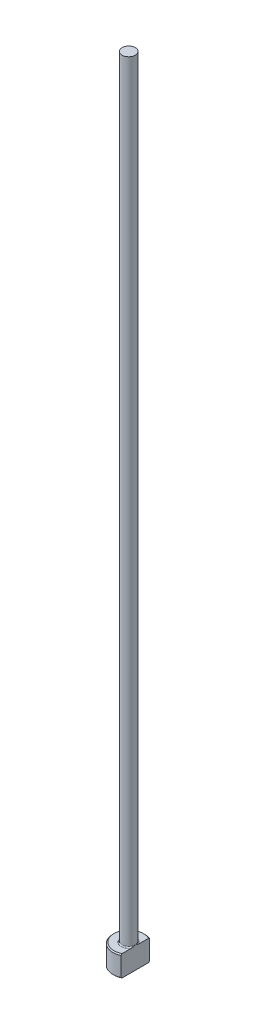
ISO-10303-21;
HEADER;
FILE_DESCRIPTION(('STEP AP214'),'2;1');
FILE_NAME('part.step','',(''),(''),'','','');
FILE_SCHEMA(('AUTOMOTIVE_DESIGN { 1 0 10303 214 1 1 1 1 }'));
ENDSEC;
DATA;
#1=APPLICATION_CONTEXT('core data for automotive mechanical design processes');
#2=APPLICATION_PROTOCOL_DEFINITION('international standard','automotive_design',2000,#1);
#3=PRODUCT_CONTEXT('',#1,'mechanical');
#4=PRODUCT('Part','Part','',(#3));
#5=PRODUCT_RELATED_PRODUCT_CATEGORY('part','',(#4));
#6=PRODUCT_DEFINITION_FORMATION('','',#4);
#7=PRODUCT_DEFINITION_CONTEXT('part definition',#1,'design');
#8=PRODUCT_DEFINITION('design','',#6,#7);
#9=PRODUCT_DEFINITION_SHAPE('','',#8);
#10=(LENGTH_UNIT() NAMED_UNIT(*) SI_UNIT(.MILLI.,.METRE.));
#11=(NAMED_UNIT(*) PLANE_ANGLE_UNIT() SI_UNIT($,.RADIAN.));
#12=(NAMED_UNIT(*) SI_UNIT($,.STERADIAN.) SOLID_ANGLE_UNIT());
#13=UNCERTAINTY_MEASURE_WITH_UNIT(LENGTH_MEASURE(1.E-05),#10,'distance_accuracy_value','');
#14=(GEOMETRIC_REPRESENTATION_CONTEXT(3) GLOBAL_UNCERTAINTY_ASSIGNED_CONTEXT((#13)) GLOBAL_UNIT_ASSIGNED_CONTEXT((#10,
#11,#12)) REPRESENTATION_CONTEXT('',''));
#15=CARTESIAN_POINT('',(0.,0.,0.));
#16=DIRECTION('',(0.,0.,1.));
#17=DIRECTION('',(1.,0.,0.));
#18=AXIS2_PLACEMENT_3D('',#15,#16,#17);
#19=CARTESIAN_POINT('',(0.,0.,0.));
#20=DIRECTION('',(0.,-1.,0.));
#21=DIRECTION('',(0.,0.,-1.));
#22=AXIS2_PLACEMENT_3D('',#19,#20,#21);
#23=PLANE('',#22);
#24=CARTESIAN_POINT('',(0.,0.,0.));
#25=DIRECTION('',(0.,-1.,0.));
#26=DIRECTION('',(0.,0.,-1.));
#27=AXIS2_PLACEMENT_3D('',#24,#25,#26);
#28=CIRCLE('',#27,2.8);
#29=CARTESIAN_POINT('',(1.24999999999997,0.,2.50549396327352));
#30=VERTEX_POINT('',#29);
#31=CARTESIAN_POINT('',(1.24999999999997,0.,-2.50549396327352));
#32=VERTEX_POINT('',#31);
#33=EDGE_CURVE('E98',#30,#32,#28,.T.);
#34=ORIENTED_EDGE('',*,*,#33,.T.);
#35=DIRECTION('',(0.,0.,1.));
#36=VECTOR('',#35,1.);
#37=CARTESIAN_POINT('',(1.24999999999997,0.,2.72717802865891));
#38=LINE('',#37,#36);
#39=EDGE_CURVE('E83',#32,#30,#38,.T.);
#40=ORIENTED_EDGE('',*,*,#39,.T.);
#41=EDGE_LOOP('',(#34,#40));
#42=FACE_BOUND('',#41,.T.);
#43=ADVANCED_FACE('F32',(#42),#23,.T.);
#44=CARTESIAN_POINT('',(0.,259.958771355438,0.));
#45=DIRECTION('',(0.,1.,0.));
#46=DIRECTION('',(0.,0.,1.));
#47=AXIS2_PLACEMENT_3D('',#44,#45,#46);
#48=CYLINDRICAL_SURFACE('',#47,2.99999999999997);
#49=CARTESIAN_POINT('',(0.,3.79999999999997,0.));
#50=DIRECTION('',(0.,1.,0.));
#51=DIRECTION('',(0.,0.,1.));
#52=AXIS2_PLACEMENT_3D('',#49,#50,#51);
#53=CIRCLE('',#52,2.99999999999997);
#54=CARTESIAN_POINT('',(1.24999999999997,3.79999999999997,2.72717802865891));
#55=VERTEX_POINT('',#54);
#56=CARTESIAN_POINT('',(1.24999999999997,3.79999999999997,-2.72717802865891));
#57=VERTEX_POINT('',#56);
#58=EDGE_CURVE('E104',#55,#57,#53,.F.);
#59=ORIENTED_EDGE('',*,*,#58,.T.);
#60=DIRECTION('',(0.,-1.,0.));
#61=VECTOR('',#60,1.);
#62=CARTESIAN_POINT('',(1.24999999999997,150.,-2.72717802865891));
#63=LINE('',#62,#61);
#64=CARTESIAN_POINT('',(1.24999999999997,0.199999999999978,-2.72717802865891));
#65=VERTEX_POINT('',#64);
#66=EDGE_CURVE('E183',#57,#65,#63,.T.);
#67=ORIENTED_EDGE('',*,*,#66,.T.);
#68=CARTESIAN_POINT('',(0.,0.199999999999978,0.));
#69=DIRECTION('',(0.,-1.,0.));
#70=DIRECTION('',(0.,0.,-1.));
#71=AXIS2_PLACEMENT_3D('',#68,#69,#70);
#72=CIRCLE('',#71,2.99999999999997);
#73=CARTESIAN_POINT('',(1.24999999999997,0.199999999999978,2.72717802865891));
#74=VERTEX_POINT('',#73);
#75=EDGE_CURVE('E100',#65,#74,#72,.F.);
#76=ORIENTED_EDGE('',*,*,#75,.T.);
#77=DIRECTION('',(0.,-1.,0.));
#78=VECTOR('',#77,1.);
#79=CARTESIAN_POINT('',(1.24999999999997,150.,2.72717802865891));
#80=LINE('',#79,#78);
#81=EDGE_CURVE('E93',#55,#74,#80,.T.);
#82=ORIENTED_EDGE('',*,*,#81,.F.);
#83=EDGE_LOOP('',(#59,#67,#76,#82));
#84=FACE_BOUND('',#83,.T.);
#85=ADVANCED_FACE('F158',(#84),#48,.T.);
#86=CARTESIAN_POINT('',(-2.99999999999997,4.,0.));
#87=DIRECTION('',(0.,1.,0.));
#88=DIRECTION('',(0.,0.,1.));
#89=AXIS2_PLACEMENT_3D('',#86,#87,#88);
#90=PLANE('',#89);
#91=CARTESIAN_POINT('',(0.,4.,0.));
#92=DIRECTION('',(0.,1.,0.));
#93=DIRECTION('',(0.,0.,1.));
#94=AXIS2_PLACEMENT_3D('',#91,#92,#93);
#95=CIRCLE('',#94,2.79999999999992);
#96=CARTESIAN_POINT('',(1.24999999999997,4.,-2.50549396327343));
#97=VERTEX_POINT('',#96);
#98=CARTESIAN_POINT('',(1.24999999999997,4.,2.50549396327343));
#99=VERTEX_POINT('',#98);
#100=EDGE_CURVE('E178',#97,#99,#95,.T.);
#101=ORIENTED_EDGE('',*,*,#100,.T.);
#102=DIRECTION('',(0.,0.,-1.));
#103=VECTOR('',#102,1.);
#104=CARTESIAN_POINT('',(1.24999999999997,4.,0.));
#105=LINE('',#104,#103);
#106=CARTESIAN_POINT('',(1.24999999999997,3.99999999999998,0.734846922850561));
#107=VERTEX_POINT('',#106);
#108=EDGE_CURVE('E57',#99,#107,#105,.T.);
#109=ORIENTED_EDGE('',*,*,#108,.T.);
#110=CARTESIAN_POINT('',(0.,4.,0.));
#111=DIRECTION('',(0.,1.,0.));
#112=DIRECTION('',(0.,0.,1.));
#113=AXIS2_PLACEMENT_3D('',#110,#111,#112);
#114=CIRCLE('',#113,1.44999999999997);
#115=CARTESIAN_POINT('',(1.24999999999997,3.99999999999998,-0.734846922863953));
#116=VERTEX_POINT('',#115);
#117=EDGE_CURVE('E107',#107,#116,#114,.F.);
#118=ORIENTED_EDGE('',*,*,#117,.T.);
#119=EDGE_CURVE('E136',#116,#97,#105,.T.);
#120=ORIENTED_EDGE('',*,*,#119,.T.);
#121=EDGE_LOOP('',(#101,#109,#118,#120));
#122=FACE_BOUND('',#121,.T.);
#123=ADVANCED_FACE('F147',(#122),#90,.T.);
#124=CARTESIAN_POINT('',(0.,4.,0.));
#125=DIRECTION('',(0.,-1.,0.));
#126=DIRECTION('',(0.,0.,-1.));
#127=AXIS2_PLACEMENT_3D('',#124,#125,#126);
#128=CONICAL_SURFACE('',#127,2.79999999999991,0.7853981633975);
#129=ORIENTED_EDGE('',*,*,#58,.F.);
#130=CARTESIAN_POINT('',(1.24999999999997,0.669029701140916,6.00219100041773));
#131=CARTESIAN_POINT('',(1.24999999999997,0.811608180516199,5.85654654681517));
#132=CARTESIAN_POINT('',(1.24999999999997,0.954083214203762,5.71080056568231));
#133=CARTESIAN_POINT('',(1.24999999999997,1.23900024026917,5.41878816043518));
#134=CARTESIAN_POINT('',(1.24999999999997,1.38144175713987,5.2725212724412));
#135=CARTESIAN_POINT('',(1.24999999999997,1.67009506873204,4.97540906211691));
#136=CARTESIAN_POINT('',(1.24999999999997,1.81629662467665,4.82455378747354));
#137=CARTESIAN_POINT('',(1.24999999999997,2.10796282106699,4.52263591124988));
#138=CARTESIAN_POINT('',(1.24999999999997,2.25342829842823,4.37157411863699));
#139=CARTESIAN_POINT('',(1.24999999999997,2.53664042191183,4.07620034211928));
#140=CARTESIAN_POINT('',(1.24999999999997,2.67441792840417,3.93191797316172));
#141=CARTESIAN_POINT('',(1.24999999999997,2.94919792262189,3.64255917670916));
#142=CARTESIAN_POINT('',(1.24999999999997,3.08620024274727,3.49748258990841));
#143=CARTESIAN_POINT('',(1.24999999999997,3.36003302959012,3.20523168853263));
#144=CARTESIAN_POINT('',(1.24999999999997,3.49685542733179,3.05804979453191));
#145=CARTESIAN_POINT('',(1.24999999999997,3.76866895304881,2.76222351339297));
#146=CARTESIAN_POINT('',(1.24999999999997,3.90366148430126,2.61358041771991));
#147=CARTESIAN_POINT('',(1.24999999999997,4.1672507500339,2.31803303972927));
#148=CARTESIAN_POINT('',(1.24999999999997,4.29592101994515,2.17119494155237));
#149=CARTESIAN_POINT('',(1.24999999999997,4.48585031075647,1.94789558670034));
#150=CARTESIAN_POINT('',(1.24999999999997,4.54874737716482,1.87283059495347));
#151=CARTESIAN_POINT('',(1.24999999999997,4.67301560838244,1.7214647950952));
#152=CARTESIAN_POINT('',(1.24999999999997,4.73438704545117,1.64516421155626));
#153=CARTESIAN_POINT('',(1.24999999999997,4.85417557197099,1.49197305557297));
#154=CARTESIAN_POINT('',(1.24999999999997,4.91262187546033,1.41510543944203));
#155=CARTESIAN_POINT('',(1.24999999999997,5.02658525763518,1.25910555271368));
#156=CARTESIAN_POINT('',(1.24999999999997,5.08209990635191,1.17997148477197));
#157=CARTESIAN_POINT('',(1.24999999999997,5.18831713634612,1.01914711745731));
#158=CARTESIAN_POINT('',(1.24999999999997,5.239044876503,0.937473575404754));
#159=CARTESIAN_POINT('',(1.24999999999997,5.33341065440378,0.770163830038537));
#160=CARTESIAN_POINT('',(1.24999999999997,5.37706287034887,0.684536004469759));
#161=CARTESIAN_POINT('',(1.24999999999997,5.42311846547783,0.577571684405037));
#162=CARTESIAN_POINT('',(1.24999999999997,5.43098597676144,0.558575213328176));
#163=CARTESIAN_POINT('',(1.24999999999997,5.44613719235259,0.520340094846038));
#164=CARTESIAN_POINT('',(1.24999999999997,5.45342063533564,0.501101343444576));
#165=CARTESIAN_POINT('',(1.24999999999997,5.46734064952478,0.462392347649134));
#166=CARTESIAN_POINT('',(1.24999999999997,5.47397728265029,0.442922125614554));
#167=CARTESIAN_POINT('',(1.24999999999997,5.48654090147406,0.403756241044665));
#168=CARTESIAN_POINT('',(1.24999999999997,5.49246793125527,0.384060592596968));
#169=CARTESIAN_POINT('',(1.24999999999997,5.50889838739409,0.325328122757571));
#170=CARTESIAN_POINT('',(1.24999999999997,5.5182970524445,0.285972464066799));
#171=CARTESIAN_POINT('',(1.24999999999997,5.53364447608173,0.206573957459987));
#172=CARTESIAN_POINT('',(1.24999999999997,5.53959211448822,0.166530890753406));
#173=CARTESIAN_POINT('',(1.24999999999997,5.54775364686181,0.0853257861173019));
#174=CARTESIAN_POINT('',(1.24999999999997,5.54989812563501,0.0441566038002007));
#175=CARTESIAN_POINT('',(1.24999999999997,5.55009472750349,-0.0381787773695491));
#176=CARTESIAN_POINT('',(1.24999999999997,5.54814807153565,-0.0793449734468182));
#177=CARTESIAN_POINT('',(1.24999999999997,5.54028608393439,-0.161410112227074));
#178=CARTESIAN_POINT('',(1.24999999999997,5.53435930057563,-0.202307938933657));
#179=CARTESIAN_POINT('',(1.24999999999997,5.5188913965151,-0.283420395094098));
#180=CARTESIAN_POINT('',(1.24999999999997,5.50934853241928,-0.323634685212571));
#181=CARTESIAN_POINT('',(1.24999999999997,5.48253027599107,-0.419701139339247));
#182=CARTESIAN_POINT('',(1.24999999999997,5.46368943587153,-0.475114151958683));
#183=CARTESIAN_POINT('',(1.24999999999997,5.42119888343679,-0.584051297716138));
#184=CARTESIAN_POINT('',(1.24999999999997,5.39754618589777,-0.637574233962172));
#185=CARTESIAN_POINT('',(1.24999999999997,5.34650154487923,-0.743173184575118));
#186=CARTESIAN_POINT('',(1.24999999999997,5.31908834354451,-0.795238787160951));
#187=CARTESIAN_POINT('',(1.24999999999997,5.26156746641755,-0.897817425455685));
#188=CARTESIAN_POINT('',(1.24999999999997,5.23146075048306,-0.948331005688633));
#189=CARTESIAN_POINT('',(1.24999999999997,5.1642123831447,-1.05610178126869));
#190=CARTESIAN_POINT('',(1.24999999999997,5.12671791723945,-1.11313743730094));
#191=CARTESIAN_POINT('',(1.24999999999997,5.04971534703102,-1.2258386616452));
#192=CARTESIAN_POINT('',(1.24999999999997,5.01020681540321,-1.28150393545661));
#193=CARTESIAN_POINT('',(1.24999999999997,4.88938978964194,-1.44694956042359));
#194=CARTESIAN_POINT('',(1.24999999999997,4.80584655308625,-1.55509257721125));
#195=CARTESIAN_POINT('',(1.24999999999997,4.63502000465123,-1.76881938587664));
#196=CARTESIAN_POINT('',(1.24999999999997,4.54772710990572,-1.87439538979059));
#197=CARTESIAN_POINT('',(1.24999999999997,4.37088701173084,-2.0835553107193));
#198=CARTESIAN_POINT('',(1.24999999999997,4.28134083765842,-2.18714010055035));
#199=CARTESIAN_POINT('',(1.24999999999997,4.10042772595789,-2.39324626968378));
#200=CARTESIAN_POINT('',(1.24999999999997,4.00905617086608,-2.4957635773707));
#201=CARTESIAN_POINT('',(1.24999999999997,3.82518962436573,-2.69980391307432));
#202=CARTESIAN_POINT('',(1.24999999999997,3.73269451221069,-2.80132683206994));
#203=CARTESIAN_POINT('',(1.24999999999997,3.45429710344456,-3.10446128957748));
#204=CARTESIAN_POINT('',(1.24999999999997,3.26719139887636,-3.30496607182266));
#205=CARTESIAN_POINT('',(1.24999999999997,2.87989899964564,-3.7161356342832));
#206=CARTESIAN_POINT('',(1.24999999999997,2.67959819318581,-3.92669240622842));
#207=CARTESIAN_POINT('',(1.24999999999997,2.27757992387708,-4.3466606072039));
#208=CARTESIAN_POINT('',(1.24999999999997,2.07586177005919,-4.55607137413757));
#209=CARTESIAN_POINT('',(1.24999999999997,1.67356669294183,-4.97197982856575));
#210=CARTESIAN_POINT('',(1.24999999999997,1.47299831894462,-5.17848579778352));
#211=CARTESIAN_POINT('',(1.24999999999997,1.0713592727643,-5.59078665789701));
#212=CARTESIAN_POINT('',(1.24999999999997,0.870288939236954,-5.79658187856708));
#213=CARTESIAN_POINT('',(1.24999999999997,0.669029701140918,-6.00219100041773));
#214=B_SPLINE_CURVE_WITH_KNOTS('',3,(#130,#131,#132,#133,#134,#135,#136,#137,#138,#139,#140,
#141,#142,#143,#144,#145,#146,#147,#148,#149,#150,#151,#152,#153,#154,#155,#156,#157,#158,#159,
#160,#161,#162,#163,#164,#165,#166,#167,#168,#169,#170,#171,#172,#173,#174,#175,#176,#177,#178,
#179,#180,#181,#182,#183,#184,#185,#186,#187,#188,#189,#190,#191,#192,#193,#194,#195,#196,#197,
#198,#199,#200,#201,#202,#203,#204,#205,#206,#207,#208,#209,#210,#211,#212,#213),.UNSPECIFIED.,
.F.,.F.,(4,2,2,2,2,2,2,2,2,2,2,2,2,2,2,2,2,2,2,2,2,2,2,2,2,2,2,2,2,2,2,2,2,2,2,2,2,2,2,2,2,4),
(0.,0.611447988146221,1.22394436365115,1.8541735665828,2.48331351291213,3.0818096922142,
3.68043067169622,4.28328558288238,4.8856485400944,5.4712985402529,5.76508275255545,
6.05881415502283,6.34846123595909,6.63834474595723,6.92660821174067,7.21428670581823,
7.27596254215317,7.33766582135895,7.39936318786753,7.46105671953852,7.58229876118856,
7.70358013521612,7.82705319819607,7.95048941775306,8.07428232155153,8.19813498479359,
8.37340718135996,8.54878844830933,8.72520546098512,8.90155985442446,9.10626834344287,
9.31102044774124,9.72083602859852,10.1317697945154,10.5425191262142,10.9544882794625,
11.3665021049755,12.1892148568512,13.0610401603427,13.9333249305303,14.7969505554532,
15.6600991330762),.UNSPECIFIED.);
#215=EDGE_CURVE('E135',#55,#99,#214,.T.);
#216=ORIENTED_EDGE('',*,*,#215,.T.);
#217=ORIENTED_EDGE('',*,*,#100,.F.);
#218=EDGE_CURVE('E127',#97,#57,#214,.T.);
#219=ORIENTED_EDGE('',*,*,#218,.T.);
#220=EDGE_LOOP('',(#129,#216,#217,#219));
#221=FACE_BOUND('',#220,.T.);
#222=ADVANCED_FACE('F143',(#221),#128,.T.);
#223=CARTESIAN_POINT('',(0.,0.199999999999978,0.));
#224=DIRECTION('',(0.,1.,0.));
#225=DIRECTION('',(0.,0.,1.));
#226=AXIS2_PLACEMENT_3D('',#223,#224,#225);
#227=CONICAL_SURFACE('',#226,2.99999999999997,0.785398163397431);
#228=ORIENTED_EDGE('',*,*,#75,.F.);
#229=CARTESIAN_POINT('',(1.24999999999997,3.33097029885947,-6.00219100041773));
#230=CARTESIAN_POINT('',(1.24999999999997,3.18839181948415,-5.85654654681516));
#231=CARTESIAN_POINT('',(1.24999999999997,3.04591678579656,-5.71080056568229));
#232=CARTESIAN_POINT('',(1.24999999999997,2.76099975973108,-5.41878816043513));
#233=CARTESIAN_POINT('',(1.24999999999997,2.61855824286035,-5.27252127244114));
#234=CARTESIAN_POINT('',(1.24999999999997,2.32990493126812,-4.97540906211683));
#235=CARTESIAN_POINT('',(1.24999999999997,2.18370337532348,-4.82455378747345));
#236=CARTESIAN_POINT('',(1.24999999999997,1.89203717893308,-4.52263591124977));
#237=CARTESIAN_POINT('',(1.24999999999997,1.74657170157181,-4.37157411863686));
#238=CARTESIAN_POINT('',(1.24999999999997,1.46335957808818,-4.07620034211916));
#239=CARTESIAN_POINT('',(1.24999999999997,1.32558207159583,-3.93191797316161));
#240=CARTESIAN_POINT('',(1.24999999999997,1.0508020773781,-3.64255917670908));
#241=CARTESIAN_POINT('',(1.24999999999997,0.913799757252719,-3.49748258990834));
#242=CARTESIAN_POINT('',(1.24999999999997,0.639966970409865,-3.2052316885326));
#243=CARTESIAN_POINT('',(1.24999999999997,0.503144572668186,-3.0580497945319));
#244=CARTESIAN_POINT('',(1.24999999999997,0.231331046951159,-2.76222351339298));
#245=CARTESIAN_POINT('',(1.24999999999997,0.096338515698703,-2.61358041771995));
#246=CARTESIAN_POINT('',(1.24999999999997,-0.16725075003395,-2.31803303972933));
#247=CARTESIAN_POINT('',(1.24999999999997,-0.2959210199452,-2.17119494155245));
#248=CARTESIAN_POINT('',(1.24999999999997,-0.485850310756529,-1.94789558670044));
#249=CARTESIAN_POINT('',(1.24999999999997,-0.548747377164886,-1.87283059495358));
#250=CARTESIAN_POINT('',(1.24999999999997,-0.673015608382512,-1.72146479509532));
#251=CARTESIAN_POINT('',(1.24999999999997,-0.73438704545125,-1.64516421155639));
#252=CARTESIAN_POINT('',(1.24999999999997,-0.854175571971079,-1.49197305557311));
#253=CARTESIAN_POINT('',(1.24999999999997,-0.912621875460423,-1.41510543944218));
#254=CARTESIAN_POINT('',(1.24999999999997,-1.02658525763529,-1.25910555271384));
#255=CARTESIAN_POINT('',(1.24999999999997,-1.08209990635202,-1.17997148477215));
#256=CARTESIAN_POINT('',(1.24999999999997,-1.18831713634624,-1.0191471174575));
#257=CARTESIAN_POINT('',(1.24999999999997,-1.23904487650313,-0.937473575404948));
#258=CARTESIAN_POINT('',(1.24999999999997,-1.33341065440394,-0.770163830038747));
#259=CARTESIAN_POINT('',(1.24999999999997,-1.37706287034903,-0.684536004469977));
#260=CARTESIAN_POINT('',(1.24999999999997,-1.42311846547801,-0.577571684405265));
#261=CARTESIAN_POINT('',(1.24999999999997,-1.43098597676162,-0.558575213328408));
#262=CARTESIAN_POINT('',(1.24999999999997,-1.44613719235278,-0.520340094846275));
#263=CARTESIAN_POINT('',(1.24999999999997,-1.45342063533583,-0.501101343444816));
#264=CARTESIAN_POINT('',(1.24999999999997,-1.46734064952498,-0.46239234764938));
#265=CARTESIAN_POINT('',(1.24999999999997,-1.47397728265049,-0.442922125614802));
#266=CARTESIAN_POINT('',(1.24999999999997,-1.48654090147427,-0.403756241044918));
#267=CARTESIAN_POINT('',(1.24999999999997,-1.49246793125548,-0.384060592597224));
#268=CARTESIAN_POINT('',(1.24999999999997,-1.50889838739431,-0.325328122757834));
#269=CARTESIAN_POINT('',(1.24999999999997,-1.51829705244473,-0.285972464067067));
#270=CARTESIAN_POINT('',(1.24999999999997,-1.53364447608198,-0.206573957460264));
#271=CARTESIAN_POINT('',(1.24999999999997,-1.53959211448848,-0.166530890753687));
#272=CARTESIAN_POINT('',(1.24999999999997,-1.54775364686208,-0.0853257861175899));
#273=CARTESIAN_POINT('',(1.24999999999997,-1.54989812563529,-0.044156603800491));
#274=CARTESIAN_POINT('',(1.24999999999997,-1.55009472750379,0.0381787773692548));
#275=CARTESIAN_POINT('',(1.24999999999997,-1.54814807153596,0.0793449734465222));
#276=CARTESIAN_POINT('',(1.24999999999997,-1.54028608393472,0.161410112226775));
#277=CARTESIAN_POINT('',(1.24999999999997,-1.53435930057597,0.202307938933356));
#278=CARTESIAN_POINT('',(1.24999999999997,-1.51889139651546,0.283420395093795));
#279=CARTESIAN_POINT('',(1.24999999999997,-1.50934853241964,0.323634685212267));
#280=CARTESIAN_POINT('',(1.24999999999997,-1.48253027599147,0.419701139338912));
#281=CARTESIAN_POINT('',(1.24999999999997,-1.46368943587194,0.475114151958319));
#282=CARTESIAN_POINT('',(1.24999999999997,-1.42119888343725,0.584051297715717));
#283=CARTESIAN_POINT('',(1.24999999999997,-1.39754618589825,0.637574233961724));
#284=CARTESIAN_POINT('',(1.24999999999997,-1.34650154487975,0.743173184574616));
#285=CARTESIAN_POINT('',(1.24999999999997,-1.31908834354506,0.795238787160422));
#286=CARTESIAN_POINT('',(1.24999999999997,-1.26156746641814,0.897817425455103));
#287=CARTESIAN_POINT('',(1.24999999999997,-1.23146075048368,0.948331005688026));
#288=CARTESIAN_POINT('',(1.24999999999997,-1.16421238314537,1.05610178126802));
#289=CARTESIAN_POINT('',(1.24999999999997,-1.12671791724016,1.11313743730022));
#290=CARTESIAN_POINT('',(1.24999999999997,-1.0497153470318,1.22583866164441));
#291=CARTESIAN_POINT('',(1.24999999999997,-1.01020681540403,1.28150393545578));
#292=CARTESIAN_POINT('',(1.24999999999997,-0.889389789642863,1.44694956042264));
#293=CARTESIAN_POINT('',(1.24999999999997,-0.805846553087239,1.55509257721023));
#294=CARTESIAN_POINT('',(1.24999999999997,-0.635020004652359,1.76881938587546));
#295=CARTESIAN_POINT('',(1.24999999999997,-0.547727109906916,1.87439538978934));
#296=CARTESIAN_POINT('',(1.24999999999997,-0.370887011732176,2.08355531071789));
#297=CARTESIAN_POINT('',(1.24999999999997,-0.281340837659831,2.18714010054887));
#298=CARTESIAN_POINT('',(1.24999999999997,-0.100427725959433,2.39324626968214));
#299=CARTESIAN_POINT('',(1.24999999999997,-0.00905617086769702,2.49576357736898));
#300=CARTESIAN_POINT('',(1.24999999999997,0.174810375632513,2.69980391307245));
#301=CARTESIAN_POINT('',(1.24999999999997,0.267305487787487,2.80132683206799));
#302=CARTESIAN_POINT('',(1.24999999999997,0.545702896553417,3.1044612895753));
#303=CARTESIAN_POINT('',(1.24999999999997,0.73280860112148,3.30496607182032));
#304=CARTESIAN_POINT('',(1.24999999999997,1.12010100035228,3.71613563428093));
#305=CARTESIAN_POINT('',(1.24999999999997,1.32040180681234,3.92669240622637));
#306=CARTESIAN_POINT('',(1.24999999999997,1.72242007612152,4.34666060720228));
#307=CARTESIAN_POINT('',(1.24999999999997,1.92413822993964,4.55607137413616));
#308=CARTESIAN_POINT('',(1.24999999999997,2.32643330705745,4.97197982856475));
#309=CARTESIAN_POINT('',(1.24999999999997,2.52700168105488,5.17848579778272));
#310=CARTESIAN_POINT('',(1.24999999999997,2.92864072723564,5.59078665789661));
#311=CARTESIAN_POINT('',(1.24999999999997,3.12971106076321,5.79658187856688));
#312=CARTESIAN_POINT('',(1.24999999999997,3.33097029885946,6.00219100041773));
#313=B_SPLINE_CURVE_WITH_KNOTS('',3,(#229,#230,#231,#232,#233,#234,#235,#236,#237,#238,#239,
#240,#241,#242,#243,#244,#245,#246,#247,#248,#249,#250,#251,#252,#253,#254,#255,#256,#257,#258,
#259,#260,#261,#262,#263,#264,#265,#266,#267,#268,#269,#270,#271,#272,#273,#274,#275,#276,#277,
#278,#279,#280,#281,#282,#283,#284,#285,#286,#287,#288,#289,#290,#291,#292,#293,#294,#295,#296,
#297,#298,#299,#300,#301,#302,#303,#304,#305,#306,#307,#308,#309,#310,#311,#312),.UNSPECIFIED.,
.F.,.F.,(4,2,2,2,2,2,2,2,2,2,2,2,2,2,2,2,2,2,2,2,2,2,2,2,2,2,2,2,2,2,2,2,2,2,2,2,2,2,2,2,2,4),
(0.,0.611447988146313,1.22394436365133,1.85417356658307,2.48331351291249,3.08180969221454,
3.68043067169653,4.28328558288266,4.88564854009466,5.47129854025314,5.76508275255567,
6.05881415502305,6.3484612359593,6.63834474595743,6.92660821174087,7.21428670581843,
7.27596254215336,7.33766582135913,7.39936318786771,7.46105671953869,7.58229876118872,
7.70358013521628,7.82705319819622,7.95048941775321,8.07428232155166,8.19813498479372,
8.37340718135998,8.54878844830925,8.72520546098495,8.90155985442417,9.10626834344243,
9.31102044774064,9.72083602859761,10.1317697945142,10.5425191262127,10.9544882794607,
11.3665021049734,12.1892148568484,13.0610401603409,13.9333249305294,14.7969505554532,
15.660099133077),.UNSPECIFIED.);
#314=EDGE_CURVE('E86',#65,#32,#313,.T.);
#315=ORIENTED_EDGE('',*,*,#314,.T.);
#316=ORIENTED_EDGE('',*,*,#33,.F.);
#317=EDGE_CURVE('E89',#30,#74,#313,.T.);
#318=ORIENTED_EDGE('',*,*,#317,.T.);
#319=EDGE_LOOP('',(#228,#315,#316,#318));
#320=FACE_BOUND('',#319,.T.);
#321=ADVANCED_FACE('F97',(#320),#227,.T.);
#322=CARTESIAN_POINT('',(0.,4.19999999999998,0.));
#323=DIRECTION('',(0.,1.,0.));
#324=DIRECTION('',(0.,0.,1.));
#325=AXIS2_PLACEMENT_3D('',#322,#323,#324);
#326=TOROIDAL_SURFACE('',#325,1.44999999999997,0.2);
#327=CARTESIAN_POINT('',(1.24999999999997,4.19999999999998,0.));
#328=CARTESIAN_POINT('',(1.24999999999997,4.20000051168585,-1.97679442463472E-10));
#329=CARTESIAN_POINT('',(1.24999999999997,4.2000010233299,-1.08908064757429E-07));
#330=CARTESIAN_POINT('',(1.24999999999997,4.2000020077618,-4.52594763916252E-07));
#331=CARTESIAN_POINT('',(1.24999999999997,4.20000247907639,-6.9099304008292E-07));
#332=CARTESIAN_POINT('',(1.24999999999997,4.20000341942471,-1.26357943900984E-06));
#333=CARTESIAN_POINT('',(1.24999999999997,4.20000388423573,-1.60457618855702E-06));
#334=CARTESIAN_POINT('',(1.24999999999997,4.20000476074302,-2.3395490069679E-06));
#335=CARTESIAN_POINT('',(1.24999999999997,4.20000517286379,-2.73304148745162E-06));
#336=CARTESIAN_POINT('',(1.24999999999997,4.20000655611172,-4.1454401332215E-06));
#337=CARTESIAN_POINT('',(1.24999999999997,4.20000745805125,-5.23310092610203E-06));
#338=CARTESIAN_POINT('',(1.24999999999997,4.20000906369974,-7.47950361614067E-06));
#339=CARTESIAN_POINT('',(1.24999999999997,4.20000977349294,-8.63414438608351E-06));
#340=CARTESIAN_POINT('',(1.24999999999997,4.20001244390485,-1.31453477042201E-05));
#341=CARTESIAN_POINT('',(1.24999999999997,4.20001426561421,-1.65880555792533E-05));
#342=CARTESIAN_POINT('',(1.24999999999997,4.20001724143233,-2.33729029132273E-05));
#343=CARTESIAN_POINT('',(1.24999999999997,4.20001844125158,-2.66956154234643E-05));
#344=CARTESIAN_POINT('',(1.24999999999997,4.20002354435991,-4.08635086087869E-05));
#345=CARTESIAN_POINT('',(1.24999999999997,4.2000274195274,-5.17114614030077E-05));
#346=CARTESIAN_POINT('',(1.24999999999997,4.2000336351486,-7.2005767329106E-05));
#347=CARTESIAN_POINT('',(1.24999999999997,4.2000361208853,-8.14057065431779E-05));
#348=CARTESIAN_POINT('',(1.24999999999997,4.20005581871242,-0.00014978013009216));
#349=CARTESIAN_POINT('',(1.24999999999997,4.20008094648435,-0.000206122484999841));
#350=CARTESIAN_POINT('',(1.24999999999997,4.20017507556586,-0.000425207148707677));
#351=CARTESIAN_POINT('',(1.24999999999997,4.20023819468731,-0.000589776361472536));
#352=CARTESIAN_POINT('',(1.24999999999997,4.20048692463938,-0.00122878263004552));
#353=CARTESIAN_POINT('',(1.24999999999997,4.20067870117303,-0.00170134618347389));
#354=CARTESIAN_POINT('',(1.24999999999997,4.20146022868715,-0.00363636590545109));
#355=CARTESIAN_POINT('',(1.24999999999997,4.20204298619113,-0.0051009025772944));
#356=CARTESIAN_POINT('',(1.24999999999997,4.20939719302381,-0.0235712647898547));
#357=CARTESIAN_POINT('',(1.24999999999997,4.21621259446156,-0.0405643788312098));
#358=CARTESIAN_POINT('',(1.24999999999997,4.22951000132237,-0.0739606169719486));
#359=CARTESIAN_POINT('',(1.24999999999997,4.23599508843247,-0.0903626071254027));
#360=CARTESIAN_POINT('',(1.24999999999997,4.24961430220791,-0.12511129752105));
#361=CARTESIAN_POINT('',(1.24999999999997,4.25673641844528,-0.143462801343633));
#362=CARTESIAN_POINT('',(1.24999999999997,4.27085039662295,-0.180427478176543));
#363=CARTESIAN_POINT('',(1.24999999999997,4.27784022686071,-0.199041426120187));
#364=CARTESIAN_POINT('',(1.24999999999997,4.29479134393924,-0.245221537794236));
#365=CARTESIAN_POINT('',(1.24999999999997,4.30459026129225,-0.272848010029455));
#366=CARTESIAN_POINT('',(1.24999999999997,4.32310234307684,-0.327738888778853));
#367=CARTESIAN_POINT('',(1.24999999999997,4.3318356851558,-0.354996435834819));
#368=CARTESIAN_POINT('',(1.24999999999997,4.34936561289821,-0.413744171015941));
#369=CARTESIAN_POINT('',(1.24999999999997,4.35799470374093,-0.445285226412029));
#370=CARTESIAN_POINT('',(1.24999999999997,4.37338463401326,-0.50909191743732));
#371=CARTESIAN_POINT('',(1.24999999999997,4.38013036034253,-0.541361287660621));
#372=CARTESIAN_POINT('',(1.24999999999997,4.39136059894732,-0.608339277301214));
#373=CARTESIAN_POINT('',(1.24999999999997,4.39568167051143,-0.643076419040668));
#374=CARTESIAN_POINT('',(1.24999999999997,4.40037605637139,-0.712733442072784));
#375=CARTESIAN_POINT('',(1.24999999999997,4.40076553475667,-0.747651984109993));
#376=CARTESIAN_POINT('',(1.24999999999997,4.39677668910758,-0.808103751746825));
#377=CARTESIAN_POINT('',(1.24999999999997,4.39361441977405,-0.833711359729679));
#378=CARTESIAN_POINT('',(1.24999999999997,4.38355990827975,-0.883915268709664));
#379=CARTESIAN_POINT('',(1.24999999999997,4.37671813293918,-0.908520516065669));
#380=CARTESIAN_POINT('',(1.24999999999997,4.36252570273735,-0.944879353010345));
#381=CARTESIAN_POINT('',(1.24999999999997,4.35688428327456,-0.957298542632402));
#382=CARTESIAN_POINT('',(1.24999999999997,4.34399066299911,-0.981318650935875));
#383=CARTESIAN_POINT('',(1.24999999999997,4.33673636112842,-0.992918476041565));
#384=CARTESIAN_POINT('',(1.24999999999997,4.32199744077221,-1.01267533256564));
#385=CARTESIAN_POINT('',(1.24999999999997,4.31482723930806,-1.02106482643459));
#386=CARTESIAN_POINT('',(1.24999999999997,4.29924321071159,-1.03659690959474));
#387=CARTESIAN_POINT('',(1.24999999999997,4.29083198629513,-1.04374204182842));
#388=CARTESIAN_POINT('',(1.24999999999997,4.27498600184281,-1.05478694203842));
#389=CARTESIAN_POINT('',(1.24999999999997,4.26780814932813,-1.059053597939));
#390=CARTESIAN_POINT('',(1.24999999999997,4.25284782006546,-1.06635953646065));
#391=CARTESIAN_POINT('',(1.24999999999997,4.24506572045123,-1.06939957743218));
#392=CARTESIAN_POINT('',(1.24999999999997,4.22901828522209,-1.07404931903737));
#393=CARTESIAN_POINT('',(1.24999999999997,4.22074990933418,-1.07564870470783));
#394=CARTESIAN_POINT('',(1.24999999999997,4.20405985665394,-1.07723717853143));
#395=CARTESIAN_POINT('',(1.24999999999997,4.19563825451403,-1.07722703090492));
#396=CARTESIAN_POINT('',(1.24999999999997,4.17988128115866,-1.07569157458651));
#397=CARTESIAN_POINT('',(1.24999999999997,4.17252879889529,-1.0743339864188));
#398=CARTESIAN_POINT('',(1.24999999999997,4.15814333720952,-1.07044616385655));
#399=CARTESIAN_POINT('',(1.24999999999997,4.15111040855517,-1.06791574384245));
#400=CARTESIAN_POINT('',(1.24999999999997,4.13724955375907,-1.06171920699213));
#401=CARTESIAN_POINT('',(1.24999999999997,4.13043935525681,-1.05801386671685));
#402=CARTESIAN_POINT('',(1.24999999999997,4.11740316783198,-1.04969609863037));
#403=CARTESIAN_POINT('',(1.24999999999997,4.11117742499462,-1.04508329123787));
#404=CARTESIAN_POINT('',(1.24999999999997,4.09586196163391,-1.03220341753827));
#405=CARTESIAN_POINT('',(1.24999999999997,4.08723799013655,-1.02338140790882));
#406=CARTESIAN_POINT('',(1.24999999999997,4.07148817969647,-1.00448021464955));
#407=CARTESIAN_POINT('',(1.24999999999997,4.0643671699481,-0.994397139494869));
#408=CARTESIAN_POINT('',(1.24999999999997,4.04800089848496,-0.967694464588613));
#409=CARTESIAN_POINT('',(1.24999999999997,4.0397014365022,-0.950498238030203));
#410=CARTESIAN_POINT('',(1.24999999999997,4.02582422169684,-0.915117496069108));
#411=CARTESIAN_POINT('',(1.24999999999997,4.02024415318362,-0.896933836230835));
#412=CARTESIAN_POINT('',(1.24999999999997,4.00805724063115,-0.84678106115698));
#413=CARTESIAN_POINT('',(1.24999999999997,4.00359525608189,-0.814297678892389));
#414=CARTESIAN_POINT('',(1.24999999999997,3.99933348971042,-0.748574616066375));
#415=CARTESIAN_POINT('',(1.24999999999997,3.99961552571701,-0.715331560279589));
#416=CARTESIAN_POINT('',(1.24999999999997,4.00446632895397,-0.637920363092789));
#417=CARTESIAN_POINT('',(1.24999999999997,4.0104488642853,-0.593849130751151));
#418=CARTESIAN_POINT('',(1.24999999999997,4.02681929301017,-0.506401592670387));
#419=CARTESIAN_POINT('',(1.24999999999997,4.03722697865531,-0.463029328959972));
#420=CARTESIAN_POINT('',(1.24999999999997,4.06007158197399,-0.380638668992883));
#421=CARTESIAN_POINT('',(1.24999999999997,4.07227412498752,-0.341553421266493));
#422=CARTESIAN_POINT('',(1.24999999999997,4.09824323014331,-0.264347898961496));
#423=CARTESIAN_POINT('',(1.24999999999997,4.11199311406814,-0.226221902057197));
#424=CARTESIAN_POINT('',(1.24999999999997,4.13108825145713,-0.175350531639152));
#425=CARTESIAN_POINT('',(1.24999999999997,4.13599999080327,-0.162438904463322));
#426=CARTESIAN_POINT('',(1.24999999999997,4.14604281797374,-0.136318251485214));
#427=CARTESIAN_POINT('',(1.24999999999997,4.15117629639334,-0.123110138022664));
#428=CARTESIAN_POINT('',(1.24999999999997,4.163417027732,-0.0918425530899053));
#429=CARTESIAN_POINT('',(1.24999999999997,4.1705525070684,-0.0737943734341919));
#430=CARTESIAN_POINT('',(1.24999999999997,4.18426943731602,-0.0393586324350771));
#431=CARTESIAN_POINT('',(1.24999999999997,4.19084281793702,-0.0229681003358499));
#432=CARTESIAN_POINT('',(1.24999999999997,4.19795564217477,-0.00510438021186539));
#433=CARTESIAN_POINT('',(1.24999999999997,4.19853702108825,-0.00364331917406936));
#434=CARTESIAN_POINT('',(1.24999999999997,4.19931818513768,-0.0017091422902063));
#435=CARTESIAN_POINT('',(1.24999999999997,4.1995110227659,-0.00123396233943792));
#436=CARTESIAN_POINT('',(1.24999999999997,4.1997610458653,-0.000591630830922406));
#437=CARTESIAN_POINT('',(1.24999999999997,4.19982443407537,-0.000426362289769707));
#438=CARTESIAN_POINT('',(1.24999999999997,4.19991892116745,-0.0002064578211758));
#439=CARTESIAN_POINT('',(1.24999999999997,4.19994410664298,-0.000149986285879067));
#440=CARTESIAN_POINT('',(1.24999999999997,4.19996383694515,-8.14647488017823E-05));
#441=CARTESIAN_POINT('',(1.24999999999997,4.19996632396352,-7.2055156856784E-05));
#442=CARTESIAN_POINT('',(1.24999999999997,4.19997254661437,-5.17396177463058E-05));
#443=CARTESIAN_POINT('',(1.24999999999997,4.19997642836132,-4.08803464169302E-05));
#444=CARTESIAN_POINT('',(1.24999999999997,4.19998153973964,-2.66997573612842E-05));
#445=CARTESIAN_POINT('',(1.24999999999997,4.19998274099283,-2.33755458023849E-05));
#446=CARTESIAN_POINT('',(1.24999999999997,4.1999857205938,-1.65878758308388E-05));
#447=CARTESIAN_POINT('',(1.24999999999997,4.19998754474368,-1.3143899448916E-05));
#448=CARTESIAN_POINT('',(1.24999999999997,4.19999021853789,-8.63150514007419E-06));
#449=CARTESIAN_POINT('',(1.24999999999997,4.19999092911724,-7.47674883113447E-06));
#450=CARTESIAN_POINT('',(1.24999999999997,4.19999253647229,-5.23027083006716E-06));
#451=CARTESIAN_POINT('',(1.24999999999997,4.19999343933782,-4.14265823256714E-06));
#452=CARTESIAN_POINT('',(1.24999999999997,4.19999482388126,-2.73051192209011E-06));
#453=CARTESIAN_POINT('',(1.24999999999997,4.19999523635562,-2.33712919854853E-06));
#454=CARTESIAN_POINT('',(1.24999999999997,4.19999611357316,-1.60243918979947E-06));
#455=CARTESIAN_POINT('',(1.24999999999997,4.19999657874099,-1.26161621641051E-06));
#456=CARTESIAN_POINT('',(1.24999999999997,4.19999751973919,-6.89449599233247E-07));
#457=CARTESIAN_POINT('',(1.24999999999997,4.19999799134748,-4.51288703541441E-07));
#458=CARTESIAN_POINT('',(1.24999999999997,4.19999897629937,-1.08178111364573E-07));
#459=CARTESIAN_POINT('',(1.24999999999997,4.1999994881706,1.97734883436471E-10));
#460=CARTESIAN_POINT('',(1.24999999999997,4.19999999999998,0.));
#461=B_SPLINE_CURVE_WITH_KNOTS('',3,(#327,#328,#329,#330,#331,#332,#333,#334,#335,#336,#337,
#338,#339,#340,#341,#342,#343,#344,#345,#346,#347,#348,#349,#350,#351,#352,#353,#354,#355,#356,
#357,#358,#359,#360,#361,#362,#363,#364,#365,#366,#367,#368,#369,#370,#371,#372,#373,#374,#375,
#376,#377,#378,#379,#380,#381,#382,#383,#384,#385,#386,#387,#388,#389,#390,#391,#392,#393,#394,
#395,#396,#397,#398,#399,#400,#401,#402,#403,#404,#405,#406,#407,#408,#409,#410,#411,#412,#413,
#414,#415,#416,#417,#418,#419,#420,#421,#422,#423,#424,#425,#426,#427,#428,#429,#430,#431,#432,
#433,#434,#435,#436,#437,#438,#439,#440,#441,#442,#443,#444,#445,#446,#447,#448,#449,#450,#451,
#452,#453,#454,#455,#456,#457,#458,#459,#460),.UNSPECIFIED.,.T.,.F.,(4,2,2,2,2,2,2,2,2,2,2,2,2,
2,2,2,2,2,2,2,2,2,2,2,2,2,2,2,2,2,2,2,2,2,2,2,2,2,2,2,2,2,2,2,2,2,2,2,2,2,2,2,2,2,2,2,2,2,2,2,2,
2,2,2,2,2,4),(0.,1.53427573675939E-06,3.11115055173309E-06,4.83351634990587E-06,
6.54098944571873E-06,1.07594293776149E-05,1.48222851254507E-05,2.64707313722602E-05,
3.70576288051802E-05,7.16088726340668E-05,0.000100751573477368,0.000285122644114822,
0.000814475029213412,0.00234373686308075,0.00707317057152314,0.0619940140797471,
0.114907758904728,0.173961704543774,0.233609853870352,0.321537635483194,0.407388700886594,
0.505443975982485,0.604264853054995,0.709126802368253,0.813557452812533,0.890773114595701,
0.96695575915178,1.0077884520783,1.04867465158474,1.08167318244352,1.11460346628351,
1.13955805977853,1.16449720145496,1.18961351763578,1.21471790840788,1.23704542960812,
1.25937648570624,1.28254952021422,1.30573226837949,1.34253218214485,1.3794485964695,
1.43640829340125,1.49331940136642,1.591136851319,1.69064301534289,1.82371118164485,
1.95738088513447,2.08016146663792,2.20172662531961,2.24316968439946,2.28568093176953,
2.34390494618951,2.39687801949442,2.4015962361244,2.40313396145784,2.40366556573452,
2.40385035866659,2.40387953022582,2.40391411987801,2.40392471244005,2.40393636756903,
2.40394043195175,2.4039446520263,2.40394636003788,2.40394808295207,2.40394966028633,
2.40395119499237),.UNSPECIFIED.);
#462=CARTESIAN_POINT('',(1.24999999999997,4.19999999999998,0.));
#463=VERTEX_POINT('',#462);
#464=EDGE_CURVE('E11',#116,#463,#461,.T.);
#465=ORIENTED_EDGE('',*,*,#464,.F.);
#466=ORIENTED_EDGE('',*,*,#117,.F.);
#467=CARTESIAN_POINT('',(1.24999999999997,4.19999999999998,0.));
#468=CARTESIAN_POINT('',(1.24999999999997,4.19999948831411,1.97679415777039E-10));
#469=CARTESIAN_POINT('',(1.24999999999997,4.19999897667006,1.08908064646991E-07));
#470=CARTESIAN_POINT('',(1.24999999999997,4.19999799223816,4.52594763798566E-07));
#471=CARTESIAN_POINT('',(1.24999999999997,4.19999752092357,6.90993040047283E-07));
#472=CARTESIAN_POINT('',(1.24999999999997,4.19999658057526,1.26357943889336E-06));
#473=CARTESIAN_POINT('',(1.24999999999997,4.19999611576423,1.60457618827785E-06));
#474=CARTESIAN_POINT('',(1.24999999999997,4.19999523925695,2.33954900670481E-06));
#475=CARTESIAN_POINT('',(1.24999999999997,4.19999482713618,2.73304148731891E-06));
#476=CARTESIAN_POINT('',(1.24999999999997,4.19999344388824,4.14544013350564E-06));
#477=CARTESIAN_POINT('',(1.24999999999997,4.19999254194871,5.23310092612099E-06));
#478=CARTESIAN_POINT('',(1.24999999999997,4.19999093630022,7.47950361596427E-06));
#479=CARTESIAN_POINT('',(1.24999999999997,4.19999022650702,8.6341443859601E-06));
#480=CARTESIAN_POINT('',(1.24999999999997,4.19998755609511,1.31453477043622E-05));
#481=CARTESIAN_POINT('',(1.24999999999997,4.19998573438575,1.65880555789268E-05));
#482=CARTESIAN_POINT('',(1.24999999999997,4.19998275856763,2.33729029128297E-05));
#483=CARTESIAN_POINT('',(1.24999999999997,4.19998155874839,2.66956154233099E-05));
#484=CARTESIAN_POINT('',(1.24999999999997,4.19997645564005,4.08635086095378E-05));
#485=CARTESIAN_POINT('',(1.24999999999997,4.19997258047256,5.17114614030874E-05));
#486=CARTESIAN_POINT('',(1.24999999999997,4.19996636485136,7.200576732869E-05));
#487=CARTESIAN_POINT('',(1.24999999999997,4.19996387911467,8.14057065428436E-05));
#488=CARTESIAN_POINT('',(1.24999999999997,4.19994418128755,0.000149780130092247));
#489=CARTESIAN_POINT('',(1.24999999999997,4.19991905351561,0.000206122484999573));
#490=CARTESIAN_POINT('',(1.24999999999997,4.1998249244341,0.000425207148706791));
#491=CARTESIAN_POINT('',(1.24999999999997,4.19976180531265,0.000589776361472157));
#492=CARTESIAN_POINT('',(1.24999999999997,4.19951307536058,0.00122878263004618));
#493=CARTESIAN_POINT('',(1.24999999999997,4.19932129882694,0.00170134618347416));
#494=CARTESIAN_POINT('',(1.24999999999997,4.19853977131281,0.00363636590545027));
#495=CARTESIAN_POINT('',(1.24999999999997,4.19795701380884,0.00510090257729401));
#496=CARTESIAN_POINT('',(1.24999999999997,4.19060280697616,0.0235712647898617));
#497=CARTESIAN_POINT('',(1.24999999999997,4.18378740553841,0.0405643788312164));
#498=CARTESIAN_POINT('',(1.24999999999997,4.17048999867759,0.0739606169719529));
#499=CARTESIAN_POINT('',(1.24999999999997,4.16400491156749,0.090362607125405));
#500=CARTESIAN_POINT('',(1.24999999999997,4.15038569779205,0.125111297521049));
#501=CARTESIAN_POINT('',(1.24999999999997,4.14326358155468,0.143462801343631));
#502=CARTESIAN_POINT('',(1.24999999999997,4.12914960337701,0.180427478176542));
#503=CARTESIAN_POINT('',(1.24999999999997,4.12215977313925,0.199041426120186));
#504=CARTESIAN_POINT('',(1.24999999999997,4.10520865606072,0.245221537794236));
#505=CARTESIAN_POINT('',(1.24999999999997,4.09540973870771,0.272848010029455));
#506=CARTESIAN_POINT('',(1.24999999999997,4.07689765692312,0.327738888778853));
#507=CARTESIAN_POINT('',(1.24999999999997,4.06816431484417,0.354996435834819));
#508=CARTESIAN_POINT('',(1.24999999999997,4.05063438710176,0.413744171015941));
#509=CARTESIAN_POINT('',(1.24999999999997,4.04200529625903,0.445285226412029));
#510=CARTESIAN_POINT('',(1.24999999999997,4.0266153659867,0.50909191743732));
#511=CARTESIAN_POINT('',(1.24999999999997,4.01986963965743,0.541361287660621));
#512=CARTESIAN_POINT('',(1.24999999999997,4.00863940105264,0.608339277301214));
#513=CARTESIAN_POINT('',(1.24999999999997,4.00431832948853,0.643076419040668));
#514=CARTESIAN_POINT('',(1.24999999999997,3.99962394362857,0.712733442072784));
#515=CARTESIAN_POINT('',(1.24999999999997,3.99923446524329,0.747651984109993));
#516=CARTESIAN_POINT('',(1.24999999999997,4.00322331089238,0.808103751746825));
#517=CARTESIAN_POINT('',(1.24999999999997,4.00638558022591,0.833711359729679));
#518=CARTESIAN_POINT('',(1.24999999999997,4.01644009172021,0.883915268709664));
#519=CARTESIAN_POINT('',(1.24999999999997,4.02328186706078,0.908520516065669));
#520=CARTESIAN_POINT('',(1.24999999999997,4.03747429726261,0.944879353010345));
#521=CARTESIAN_POINT('',(1.24999999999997,4.0431157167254,0.957298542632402));
#522=CARTESIAN_POINT('',(1.24999999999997,4.05600933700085,0.981318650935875));
#523=CARTESIAN_POINT('',(1.24999999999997,4.06326363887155,0.992918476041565));
#524=CARTESIAN_POINT('',(1.24999999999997,4.07800255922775,1.01267533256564));
#525=CARTESIAN_POINT('',(1.24999999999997,4.08517276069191,1.02106482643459));
#526=CARTESIAN_POINT('',(1.24999999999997,4.10075678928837,1.03659690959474));
#527=CARTESIAN_POINT('',(1.24999999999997,4.10916801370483,1.04374204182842));
#528=CARTESIAN_POINT('',(1.24999999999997,4.12501399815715,1.05478694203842));
#529=CARTESIAN_POINT('',(1.24999999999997,4.13219185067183,1.059053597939));
#530=CARTESIAN_POINT('',(1.24999999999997,4.1471521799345,1.06635953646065));
#531=CARTESIAN_POINT('',(1.24999999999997,4.15493427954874,1.06939957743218));
#532=CARTESIAN_POINT('',(1.24999999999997,4.17098171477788,1.07404931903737));
#533=CARTESIAN_POINT('',(1.24999999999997,4.17925009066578,1.07564870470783));
#534=CARTESIAN_POINT('',(1.24999999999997,4.19594014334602,1.07723717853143));
#535=CARTESIAN_POINT('',(1.24999999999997,4.20436174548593,1.07722703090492));
#536=CARTESIAN_POINT('',(1.24999999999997,4.2201187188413,1.07569157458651));
#537=CARTESIAN_POINT('',(1.24999999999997,4.22747120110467,1.0743339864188));
#538=CARTESIAN_POINT('',(1.24999999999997,4.24185666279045,1.07044616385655));
#539=CARTESIAN_POINT('',(1.24999999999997,4.24888959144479,1.06791574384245));
#540=CARTESIAN_POINT('',(1.24999999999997,4.26275044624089,1.06171920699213));
#541=CARTESIAN_POINT('',(1.24999999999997,4.26956064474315,1.05801386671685));
#542=CARTESIAN_POINT('',(1.24999999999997,4.28259683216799,1.04969609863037));
#543=CARTESIAN_POINT('',(1.24999999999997,4.28882257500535,1.04508329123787));
#544=CARTESIAN_POINT('',(1.24999999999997,4.30413803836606,1.03220341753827));
#545=CARTESIAN_POINT('',(1.24999999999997,4.31276200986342,1.02338140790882));
#546=CARTESIAN_POINT('',(1.24999999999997,4.32851182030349,1.00448021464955));
#547=CARTESIAN_POINT('',(1.24999999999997,4.33563283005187,0.994397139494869));
#548=CARTESIAN_POINT('',(1.24999999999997,4.351999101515,0.967694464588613));
#549=CARTESIAN_POINT('',(1.24999999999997,4.36029856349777,0.950498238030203));
#550=CARTESIAN_POINT('',(1.24999999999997,4.37417577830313,0.915117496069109));
#551=CARTESIAN_POINT('',(1.24999999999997,4.37975584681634,0.896933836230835));
#552=CARTESIAN_POINT('',(1.24999999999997,4.39194275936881,0.84678106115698));
#553=CARTESIAN_POINT('',(1.24999999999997,4.39640474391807,0.814297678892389));
#554=CARTESIAN_POINT('',(1.24999999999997,4.40066651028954,0.748574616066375));
#555=CARTESIAN_POINT('',(1.24999999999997,4.40038447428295,0.715331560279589));
#556=CARTESIAN_POINT('',(1.24999999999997,4.395533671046,0.637920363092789));
#557=CARTESIAN_POINT('',(1.24999999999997,4.38955113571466,0.593849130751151));
#558=CARTESIAN_POINT('',(1.24999999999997,4.3731807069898,0.506401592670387));
#559=CARTESIAN_POINT('',(1.24999999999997,4.36277302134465,0.463029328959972));
#560=CARTESIAN_POINT('',(1.24999999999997,4.33992841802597,0.380638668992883));
#561=CARTESIAN_POINT('',(1.24999999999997,4.32772587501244,0.341553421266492));
#562=CARTESIAN_POINT('',(1.24999999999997,4.30175676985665,0.264347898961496));
#563=CARTESIAN_POINT('',(1.24999999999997,4.28800688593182,0.226221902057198));
#564=CARTESIAN_POINT('',(1.24999999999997,4.26891174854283,0.175350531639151));
#565=CARTESIAN_POINT('',(1.24999999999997,4.26400000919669,0.162438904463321));
#566=CARTESIAN_POINT('',(1.24999999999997,4.25395718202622,0.136318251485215));
#567=CARTESIAN_POINT('',(1.24999999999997,4.24882370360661,0.123110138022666));
#568=CARTESIAN_POINT('',(1.24999999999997,4.23658297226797,0.0918425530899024));
#569=CARTESIAN_POINT('',(1.24999999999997,4.22944749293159,0.0737943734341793));
#570=CARTESIAN_POINT('',(1.24999999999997,4.21573056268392,0.0393586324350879));
#571=CARTESIAN_POINT('',(1.24999999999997,4.20915718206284,0.0229681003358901));
#572=CARTESIAN_POINT('',(1.24999999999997,4.2020443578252,0.0051043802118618));
#573=CARTESIAN_POINT('',(1.24999999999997,4.20146297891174,0.00364331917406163));
#574=CARTESIAN_POINT('',(1.24999999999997,4.20068181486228,0.00170914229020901));
#575=CARTESIAN_POINT('',(1.24999999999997,4.20048897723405,0.0012339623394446));
#576=CARTESIAN_POINT('',(1.24999999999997,4.20023895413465,0.000591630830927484));
#577=CARTESIAN_POINT('',(1.24999999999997,4.20017556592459,0.000426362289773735));
#578=CARTESIAN_POINT('',(1.24999999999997,4.20008107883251,0.000206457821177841));
#579=CARTESIAN_POINT('',(1.24999999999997,4.20005589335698,0.000149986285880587));
#580=CARTESIAN_POINT('',(1.24999999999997,4.20003616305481,8.14647488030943E-05));
#581=CARTESIAN_POINT('',(1.24999999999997,4.20003367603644,7.20551568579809E-05));
#582=CARTESIAN_POINT('',(1.24999999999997,4.2000274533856,5.17396177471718E-05));
#583=CARTESIAN_POINT('',(1.24999999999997,4.20002357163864,4.08803464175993E-05));
#584=CARTESIAN_POINT('',(1.24999999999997,4.20001846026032,2.66997573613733E-05));
#585=CARTESIAN_POINT('',(1.24999999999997,4.20001725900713,2.33755458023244E-05));
#586=CARTESIAN_POINT('',(1.24999999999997,4.20001427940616,1.65878758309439E-05));
#587=CARTESIAN_POINT('',(1.24999999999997,4.20001245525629,1.31438994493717E-05));
#588=CARTESIAN_POINT('',(1.24999999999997,4.20000978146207,8.63150513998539E-06));
#589=CARTESIAN_POINT('',(1.24999999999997,4.20000907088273,7.47674883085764E-06));
#590=CARTESIAN_POINT('',(1.24999999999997,4.20000746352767,5.23027082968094E-06));
#591=CARTESIAN_POINT('',(1.24999999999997,4.20000656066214,4.14265823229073E-06));
#592=CARTESIAN_POINT('',(1.24999999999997,4.2000051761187,2.73051192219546E-06));
#593=CARTESIAN_POINT('',(1.24999999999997,4.20000476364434,2.33712919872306E-06));
#594=CARTESIAN_POINT('',(1.24999999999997,4.2000038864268,1.60243919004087E-06));
#595=CARTESIAN_POINT('',(1.24999999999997,4.20000342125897,1.2616162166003E-06));
#596=CARTESIAN_POINT('',(1.24999999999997,4.20000248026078,6.89449599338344E-07));
#597=CARTESIAN_POINT('',(1.24999999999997,4.20000200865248,4.51288703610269E-07));
#598=CARTESIAN_POINT('',(1.24999999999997,4.20000102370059,1.08178111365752E-07));
#599=CARTESIAN_POINT('',(1.24999999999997,4.20000051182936,-1.97734856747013E-10));
#600=CARTESIAN_POINT('',(1.24999999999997,4.19999999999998,0.));
#601=B_SPLINE_CURVE_WITH_KNOTS('',3,(#467,#468,#469,#470,#471,#472,#473,#474,#475,#476,#477,
#478,#479,#480,#481,#482,#483,#484,#485,#486,#487,#488,#489,#490,#491,#492,#493,#494,#495,#496,
#497,#498,#499,#500,#501,#502,#503,#504,#505,#506,#507,#508,#509,#510,#511,#512,#513,#514,#515,
#516,#517,#518,#519,#520,#521,#522,#523,#524,#525,#526,#527,#528,#529,#530,#531,#532,#533,#534,
#535,#536,#537,#538,#539,#540,#541,#542,#543,#544,#545,#546,#547,#548,#549,#550,#551,#552,#553,
#554,#555,#556,#557,#558,#559,#560,#561,#562,#563,#564,#565,#566,#567,#568,#569,#570,#571,#572,
#573,#574,#575,#576,#577,#578,#579,#580,#581,#582,#583,#584,#585,#586,#587,#588,#589,#590,#591,
#592,#593,#594,#595,#596,#597,#598,#599,#600),.UNSPECIFIED.,.T.,.F.,(4,2,2,2,2,2,2,2,2,2,2,2,2,
2,2,2,2,2,2,2,2,2,2,2,2,2,2,2,2,2,2,2,2,2,2,2,2,2,2,2,2,2,2,2,2,2,2,2,2,2,2,2,2,2,2,2,2,2,2,2,2,
2,2,2,2,2,4),(0.,1.53427573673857E-06,3.11115055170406E-06,4.83351635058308E-06,
6.54098944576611E-06,1.07594293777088E-05,1.4822285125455E-05,2.64707313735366E-05,
3.70576288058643E-05,7.16088726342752E-05,0.000100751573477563,0.000285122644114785,
0.000814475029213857,0.0023437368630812,0.00707317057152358,0.0619940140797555,
0.114907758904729,0.173961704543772,0.233609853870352,0.321537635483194,0.407388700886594,
0.505443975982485,0.604264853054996,0.709126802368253,0.813557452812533,0.890773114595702,
0.96695575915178,1.0077884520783,1.04867465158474,1.08167318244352,1.11460346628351,
1.13955805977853,1.16449720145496,1.18961351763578,1.21471790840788,1.23704542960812,
1.25937648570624,1.28254952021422,1.30573226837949,1.34253218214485,1.3794485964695,
1.43640829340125,1.49331940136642,1.591136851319,1.69064301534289,1.82371118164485,
1.95738088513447,2.08016146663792,2.20172662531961,2.24316968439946,2.28568093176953,
2.34390494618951,2.39687801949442,2.4015962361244,2.40313396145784,2.40366556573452,
2.40385035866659,2.40387953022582,2.40391411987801,2.40392471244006,2.40393636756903,
2.40394043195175,2.4039446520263,2.40394636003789,2.40394808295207,2.40394966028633,
2.40395119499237),.UNSPECIFIED.);
#602=EDGE_CURVE('E46',#463,#107,#601,.T.);
#603=ORIENTED_EDGE('',*,*,#602,.F.);
#604=CARTESIAN_POINT('',(0.,4.19999999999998,0.));
#605=DIRECTION('',(0.,1.,0.));
#606=DIRECTION('',(0.,0.,1.));
#607=AXIS2_PLACEMENT_3D('',#604,#605,#606);
#608=CIRCLE('',#607,1.24999999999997);
#609=EDGE_CURVE('E103',#463,#463,#608,.T.);
#610=ORIENTED_EDGE('',*,*,#609,.F.);
#611=EDGE_LOOP('',(#465,#466,#603,#610));
#612=FACE_BOUND('',#611,.T.);
#613=ADVANCED_FACE('F34',(#612),#326,.F.);
#614=CARTESIAN_POINT('',(0.,259.958771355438,0.));
#615=DIRECTION('',(0.,1.,0.));
#616=DIRECTION('',(0.,0.,1.));
#617=AXIS2_PLACEMENT_3D('',#614,#615,#616);
#618=CYLINDRICAL_SURFACE('',#617,1.24999999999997);
#619=ORIENTED_EDGE('',*,*,#609,.T.);
#620=EDGE_LOOP('',(#619));
#621=FACE_BOUND('',#620,.T.);
#622=CARTESIAN_POINT('',(0.,150.,0.));
#623=DIRECTION('',(0.,1.,0.));
#624=DIRECTION('',(0.,0.,1.));
#625=AXIS2_PLACEMENT_3D('',#622,#623,#624);
#626=CIRCLE('',#625,1.24999999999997);
#627=CARTESIAN_POINT('',(0.,150.,1.24999999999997));
#628=VERTEX_POINT('',#627);
#629=EDGE_CURVE('E101',#628,#628,#626,.T.);
#630=ORIENTED_EDGE('',*,*,#629,.F.);
#631=EDGE_LOOP('',(#630));
#632=FACE_BOUND('',#631,.T.);
#633=ADVANCED_FACE('F155',(#621,#632),#618,.T.);
#634=CARTESIAN_POINT('',(-1.24999999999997,150.,0.));
#635=DIRECTION('',(0.,1.,0.));
#636=DIRECTION('',(0.,0.,1.));
#637=AXIS2_PLACEMENT_3D('',#634,#635,#636);
#638=PLANE('',#637);
#639=ORIENTED_EDGE('',*,*,#629,.T.);
#640=EDGE_LOOP('',(#639));
#641=FACE_BOUND('',#640,.T.);
#642=ADVANCED_FACE('F121',(#641),#638,.T.);
#643=CARTESIAN_POINT('',(1.24999999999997,150.,2.72717802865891));
#644=DIRECTION('',(1.,0.,0.));
#645=DIRECTION('',(0.,0.,-1.));
#646=AXIS2_PLACEMENT_3D('',#643,#644,#645);
#647=PLANE('',#646);
#648=ORIENTED_EDGE('',*,*,#66,.F.);
#649=ORIENTED_EDGE('',*,*,#218,.F.);
#650=ORIENTED_EDGE('',*,*,#119,.F.);
#651=ORIENTED_EDGE('',*,*,#464,.T.);
#652=ORIENTED_EDGE('',*,*,#602,.T.);
#653=ORIENTED_EDGE('',*,*,#108,.F.);
#654=ORIENTED_EDGE('',*,*,#215,.F.);
#655=ORIENTED_EDGE('',*,*,#81,.T.);
#656=ORIENTED_EDGE('',*,*,#317,.F.);
#657=ORIENTED_EDGE('',*,*,#39,.F.);
#658=ORIENTED_EDGE('',*,*,#314,.F.);
#659=EDGE_LOOP('',(#648,#649,#650,#651,#652,#653,#654,#655,#656,#657,#658));
#660=FACE_BOUND('',#659,.T.);
#661=ADVANCED_FACE('F85',(#660),#647,.T.);
#662=CLOSED_SHELL('',(#43,#85,#123,#222,#321,#613,#633,#642,#661));
#663=MANIFOLD_SOLID_BREP('B2',#662);
#664=ADVANCED_BREP_SHAPE_REPRESENTATION('',(#18,#663),#14);
#665=SHAPE_DEFINITION_REPRESENTATION(#9,#664);
ENDSEC;
END-ISO-10303-21;
